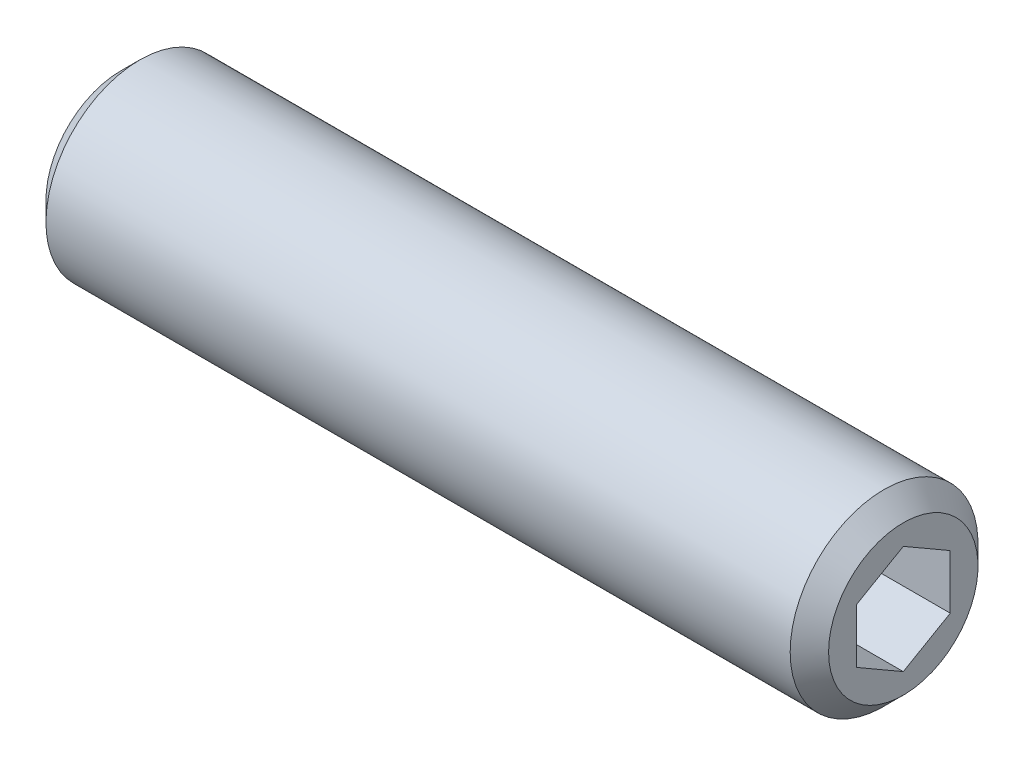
ISO-10303-21;
HEADER;
FILE_DESCRIPTION(('STEP AP214'),'2;1');
FILE_NAME('part.step','',(''),(''),'','','');
FILE_SCHEMA(('AUTOMOTIVE_DESIGN { 1 0 10303 214 1 1 1 1 }'));
ENDSEC;
DATA;
#1=APPLICATION_CONTEXT('core data for automotive mechanical design processes');
#2=APPLICATION_PROTOCOL_DEFINITION('international standard','automotive_design',2000,#1);
#3=PRODUCT_CONTEXT('',#1,'mechanical');
#4=PRODUCT('Part','Part','',(#3));
#5=PRODUCT_RELATED_PRODUCT_CATEGORY('part','',(#4));
#6=PRODUCT_DEFINITION_FORMATION('','',#4);
#7=PRODUCT_DEFINITION_CONTEXT('part definition',#1,'design');
#8=PRODUCT_DEFINITION('design','',#6,#7);
#9=PRODUCT_DEFINITION_SHAPE('','',#8);
#10=(LENGTH_UNIT() NAMED_UNIT(*) SI_UNIT(.MILLI.,.METRE.));
#11=(NAMED_UNIT(*) PLANE_ANGLE_UNIT() SI_UNIT($,.RADIAN.));
#12=(NAMED_UNIT(*) SI_UNIT($,.STERADIAN.) SOLID_ANGLE_UNIT());
#13=UNCERTAINTY_MEASURE_WITH_UNIT(LENGTH_MEASURE(1.E-05),#10,'distance_accuracy_value','');
#14=(GEOMETRIC_REPRESENTATION_CONTEXT(3) GLOBAL_UNCERTAINTY_ASSIGNED_CONTEXT((#13)) GLOBAL_UNIT_ASSIGNED_CONTEXT((#10,
#11,#12)) REPRESENTATION_CONTEXT('',''));
#15=CARTESIAN_POINT('',(0.,0.,0.));
#16=DIRECTION('',(0.,0.,1.));
#17=DIRECTION('',(1.,0.,0.));
#18=AXIS2_PLACEMENT_3D('',#15,#16,#17);
#19=CARTESIAN_POINT('',(25.,0.86602540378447,-1.49999999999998));
#20=DIRECTION('',(0.,0.866025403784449,-0.499999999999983));
#21=DIRECTION('',(0.,0.499999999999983,0.866025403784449));
#22=AXIS2_PLACEMENT_3D('',#19,#20,#21);
#23=PLANE('',#22);
#24=DIRECTION('',(-1.,0.,0.));
#25=VECTOR('',#24,1.);
#26=CARTESIAN_POINT('',(25.,0.866025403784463,-1.50000000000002));
#27=LINE('',#26,#25);
#28=CARTESIAN_POINT('',(21.4999999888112,0.866025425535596,-1.49999996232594));
#29=VERTEX_POINT('',#28);
#30=CARTESIAN_POINT('',(25.,0.866025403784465,-1.50000000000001));
#31=VERTEX_POINT('',#30);
#32=EDGE_CURVE('E188',#29,#31,#27,.F.);
#33=ORIENTED_EDGE('',*,*,#32,.T.);
#34=DIRECTION('',(0.,0.499999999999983,0.866025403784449));
#35=VECTOR('',#34,1.);
#36=CARTESIAN_POINT('',(25.,0.86602540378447,-1.49999999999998));
#37=LINE('',#36,#35);
#38=CARTESIAN_POINT('',(25.,1.73205080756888,0.));
#39=VERTEX_POINT('',#38);
#40=EDGE_CURVE('E192',#39,#31,#37,.F.);
#41=ORIENTED_EDGE('',*,*,#40,.F.);
#42=DIRECTION('',(1.,0.,0.));
#43=VECTOR('',#42,1.);
#44=CARTESIAN_POINT('',(25.,1.73205080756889,0.));
#45=LINE('',#44,#43);
#46=CARTESIAN_POINT('',(21.4999999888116,1.73205078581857,3.76726784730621E-08));
#47=VERTEX_POINT('',#46);
#48=EDGE_CURVE('E89',#39,#47,#45,.F.);
#49=ORIENTED_EDGE('',*,*,#48,.T.);
#50=CARTESIAN_POINT('',(21.5000000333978,1.73205078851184,4.15244747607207E-08));
#51=CARTESIAN_POINT('',(21.4780216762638,1.69399423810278,-0.0659158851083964));
#52=CARTESIAN_POINT('',(21.4580335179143,1.65560917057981,-0.132400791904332));
#53=CARTESIAN_POINT('',(21.4231447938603,1.57817441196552,-0.266521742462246));
#54=CARTESIAN_POINT('',(21.4082565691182,1.53912334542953,-0.334160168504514));
#55=CARTESIAN_POINT('',(21.3850819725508,1.46150515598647,-0.468598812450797));
#56=CARTESIAN_POINT('',(21.3766413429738,1.42294997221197,-0.535378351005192));
#57=CARTESIAN_POINT('',(21.3665668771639,1.34565828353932,-0.66925148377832));
#58=CARTESIAN_POINT('',(21.3649246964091,1.30692205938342,-0.736344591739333));
#59=CARTESIAN_POINT('',(21.3683497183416,1.23454758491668,-0.861700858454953));
#60=CARTESIAN_POINT('',(21.372575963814,1.20089847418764,-0.919982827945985));
#61=CARTESIAN_POINT('',(21.3859679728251,1.13381946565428,-1.03616707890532));
#62=CARTESIAN_POINT('',(21.3951383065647,1.10038979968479,-1.09406895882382));
#63=CARTESIAN_POINT('',(21.4180623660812,1.03317260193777,-1.21049256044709));
#64=CARTESIAN_POINT('',(21.4319132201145,0.999393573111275,-1.26899955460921));
#65=CARTESIAN_POINT('',(21.4633488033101,0.932339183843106,-1.38514116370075));
#66=CARTESIAN_POINT('',(21.4809261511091,0.899062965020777,-1.44277726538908));
#67=CARTESIAN_POINT('',(21.4999999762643,0.866025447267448,-1.49999992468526));
#68=B_SPLINE_CURVE_WITH_KNOTS('',3,(#50,#51,#52,#53,#54,#55,#56,#57,#58,#59,#60,#61,#62,#63,#64,
#65,#66,#67),.UNSPECIFIED.,.F.,.F.,(4,2,2,2,2,2,2,2,4),(0.,0.23776201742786,0.476095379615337,
0.708530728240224,0.940680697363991,1.14278084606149,1.34506813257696,1.55184118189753,
1.75820842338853),.UNSPECIFIED.);
#69=EDGE_CURVE('E88',#47,#29,#68,.T.);
#70=ORIENTED_EDGE('',*,*,#69,.T.);
#71=EDGE_LOOP('',(#33,#41,#49,#70));
#72=FACE_BOUND('',#71,.T.);
#73=ADVANCED_FACE('F16',(#72),#23,.F.);
#74=CARTESIAN_POINT('',(25.,-0.866025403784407,-1.50000000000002));
#75=DIRECTION('',(0.,0.,-1.));
#76=DIRECTION('',(-1.,0.,0.));
#77=AXIS2_PLACEMENT_3D('',#74,#75,#76);
#78=PLANE('',#77);
#79=DIRECTION('',(1.,0.,0.));
#80=VECTOR('',#79,1.);
#81=CARTESIAN_POINT('',(25.,-0.866025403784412,-1.50000000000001));
#82=LINE('',#81,#80);
#83=CARTESIAN_POINT('',(21.4999999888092,-0.866025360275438,-1.50000000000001));
#84=VERTEX_POINT('',#83);
#85=CARTESIAN_POINT('',(25.,-0.86602540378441,-1.50000000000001));
#86=VERTEX_POINT('',#85);
#87=EDGE_CURVE('E187',#84,#86,#82,.T.);
#88=ORIENTED_EDGE('',*,*,#87,.T.);
#89=DIRECTION('',(0.,1.,0.));
#90=VECTOR('',#89,1.);
#91=CARTESIAN_POINT('',(25.,-0.866025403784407,-1.50000000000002));
#92=LINE('',#91,#90);
#93=EDGE_CURVE('E185',#31,#86,#92,.F.);
#94=ORIENTED_EDGE('',*,*,#93,.F.);
#95=ORIENTED_EDGE('',*,*,#32,.F.);
#96=CARTESIAN_POINT('',(21.5000000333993,0.866025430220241,-1.49999996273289));
#97=CARTESIAN_POINT('',(21.4780216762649,0.78991228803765,-1.49999998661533));
#98=CARTESIAN_POINT('',(21.4580335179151,0.713142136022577,-1.4999999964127));
#99=CARTESIAN_POINT('',(21.4231447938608,0.558272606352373,-1.50000000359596));
#100=CARTESIAN_POINT('',(21.4082565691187,0.480170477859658,-1.50000000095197));
#101=CARTESIAN_POINT('',(21.3850819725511,0.32493410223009,-1.49999999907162));
#102=CARTESIAN_POINT('',(21.3766413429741,0.247823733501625,-1.49999999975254));
#103=CARTESIAN_POINT('',(21.3665668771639,0.0932403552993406,-1.5000000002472));
#104=CARTESIAN_POINT('',(21.3649246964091,0.0157679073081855,-1.500000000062));
#105=CARTESIAN_POINT('',(21.3683497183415,-0.128981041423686,-1.49999999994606));
#106=CARTESIAN_POINT('',(21.3725759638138,-0.196279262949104,-1.49999999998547));
#107=CARTESIAN_POINT('',(21.3859679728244,-0.330437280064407,-1.50000000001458));
#108=CARTESIAN_POINT('',(21.3951383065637,-0.397296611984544,-1.50000000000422));
#109=CARTESIAN_POINT('',(21.4180623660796,-0.531731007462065,-1.49999999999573));
#110=CARTESIAN_POINT('',(21.4319132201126,-0.599289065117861,-1.49999999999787));
#111=CARTESIAN_POINT('',(21.4633488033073,-0.733397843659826,-1.50000000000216));
#112=CARTESIAN_POINT('',(21.4809261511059,-0.799950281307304,-1.50000000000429));
#113=CARTESIAN_POINT('',(21.4999999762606,-0.866025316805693,-1.50000000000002));
#114=B_SPLINE_CURVE_WITH_KNOTS('',3,(#96,#97,#98,#99,#100,#101,#102,#103,#104,#105,#106,#107,
#108,#109,#110,#111,#112,#113),.UNSPECIFIED.,.F.,.F.,(4,2,2,2,2,2,2,2,4),(0.,0.23776201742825,
0.476095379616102,0.708530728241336,0.940680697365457,1.14278084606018,1.34506813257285,
1.55184118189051,1.75820842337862),.UNSPECIFIED.);
#115=EDGE_CURVE('E129',#29,#84,#114,.T.);
#116=ORIENTED_EDGE('',*,*,#115,.T.);
#117=EDGE_LOOP('',(#88,#94,#95,#116));
#118=FACE_BOUND('',#117,.T.);
#119=ADVANCED_FACE('F133',(#118),#78,.F.);
#120=CARTESIAN_POINT('',(25.,-1.73205080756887,0.));
#121=DIRECTION('',(0.,-0.866025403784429,-0.500000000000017));
#122=DIRECTION('',(0.,0.500000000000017,-0.866025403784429));
#123=AXIS2_PLACEMENT_3D('',#120,#121,#122);
#124=PLANE('',#123);
#125=DIRECTION('',(1.,0.,0.));
#126=VECTOR('',#125,1.);
#127=CARTESIAN_POINT('',(25.,-1.73205080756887,0.));
#128=LINE('',#127,#126);
#129=CARTESIAN_POINT('',(21.4999999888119,-1.73205078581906,-3.76718099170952E-08));
#130=VERTEX_POINT('',#129);
#131=CARTESIAN_POINT('',(25.,-1.73205080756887,0.));
#132=VERTEX_POINT('',#131);
#133=EDGE_CURVE('E191',#130,#132,#128,.T.);
#134=ORIENTED_EDGE('',*,*,#133,.T.);
#135=DIRECTION('',(0.,0.500000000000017,-0.866025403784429));
#136=VECTOR('',#135,1.);
#137=CARTESIAN_POINT('',(25.,-1.73205080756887,0.));
#138=LINE('',#137,#136);
#139=EDGE_CURVE('E189',#86,#132,#138,.F.);
#140=ORIENTED_EDGE('',*,*,#139,.F.);
#141=ORIENTED_EDGE('',*,*,#87,.F.);
#142=CARTESIAN_POINT('',(21.5000000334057,-0.86602535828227,-1.5000000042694));
#143=CARTESIAN_POINT('',(21.4780216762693,-0.904081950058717,-1.43408410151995));
#144=CARTESIAN_POINT('',(21.4580335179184,-0.942467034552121,-1.36759920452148));
#145=CARTESIAN_POINT('',(21.4231447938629,-1.01990180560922,-1.23347826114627));
#146=CARTESIAN_POINT('',(21.4082565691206,-1.05895286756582,-1.16583983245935));
#147=CARTESIAN_POINT('',(21.3850819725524,-1.13657105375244,-1.03140118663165));
#148=CARTESIAN_POINT('',(21.376641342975,-1.17512623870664,-0.964621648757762));
#149=CARTESIAN_POINT('',(21.3665668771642,-1.25241792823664,-0.830748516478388));
#150=CARTESIAN_POINT('',(21.3649246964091,-1.29115415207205,-0.763655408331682));
#151=CARTESIAN_POINT('',(21.3683497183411,-1.36352862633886,-0.638299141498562));
#152=CARTESIAN_POINT('',(21.3725759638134,-1.39717773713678,-0.580017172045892));
#153=CARTESIAN_POINT('',(21.3859679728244,-1.46425674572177,-0.463832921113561));
#154=CARTESIAN_POINT('',(21.3951383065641,-1.49768641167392,-0.405931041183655));
#155=CARTESIAN_POINT('',(21.4180623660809,-1.56490360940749,-0.28950743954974));
#156=CARTESIAN_POINT('',(21.4319132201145,-1.59868263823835,-0.231000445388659));
#157=CARTESIAN_POINT('',(21.4633488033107,-1.66573702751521,-0.114858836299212));
#158=CARTESIAN_POINT('',(21.4809261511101,-1.69901324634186,-0.0572227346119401));
#159=CARTESIAN_POINT('',(21.4999999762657,-1.7320507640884,-7.53104211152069E-08));
#160=B_SPLINE_CURVE_WITH_KNOTS('',3,(#142,#143,#144,#145,#146,#147,#148,#149,#150,#151,#152,
#153,#154,#155,#156,#157,#158,#159),.UNSPECIFIED.,.F.,.F.,(4,2,2,2,2,2,2,2,4),(0.,
0.237762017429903,0.47609537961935,0.708530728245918,0.940680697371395,1.14278084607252,
1.34506813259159,1.55184118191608,1.75820842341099),.UNSPECIFIED.);
#161=EDGE_CURVE('E124',#84,#130,#160,.T.);
#162=ORIENTED_EDGE('',*,*,#161,.T.);
#163=EDGE_LOOP('',(#134,#140,#141,#162));
#164=FACE_BOUND('',#163,.T.);
#165=ADVANCED_FACE('F136',(#164),#124,.F.);
#166=CARTESIAN_POINT('',(25.,-0.866025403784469,1.49999999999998));
#167=DIRECTION('',(0.,-0.866025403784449,0.499999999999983));
#168=DIRECTION('',(0.,-0.499999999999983,-0.866025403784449));
#169=AXIS2_PLACEMENT_3D('',#166,#167,#168);
#170=PLANE('',#169);
#171=DIRECTION('',(1.,0.,0.));
#172=VECTOR('',#171,1.);
#173=CARTESIAN_POINT('',(25.,-0.866025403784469,1.50000000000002));
#174=LINE('',#173,#172);
#175=CARTESIAN_POINT('',(21.4999999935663,-0.866025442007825,1.49999996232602));
#176=VERTEX_POINT('',#175);
#177=CARTESIAN_POINT('',(25.,-0.866025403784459,1.50000000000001));
#178=VERTEX_POINT('',#177);
#179=EDGE_CURVE('E80',#176,#178,#174,.T.);
#180=ORIENTED_EDGE('',*,*,#179,.T.);
#181=DIRECTION('',(0.,-0.499999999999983,-0.866025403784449));
#182=VECTOR('',#181,1.);
#183=CARTESIAN_POINT('',(25.,-0.866025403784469,1.49999999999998));
#184=LINE('',#183,#182);
#185=EDGE_CURVE('E198',#132,#178,#184,.F.);
#186=ORIENTED_EDGE('',*,*,#185,.F.);
#187=ORIENTED_EDGE('',*,*,#133,.F.);
#188=CARTESIAN_POINT('',(21.5000000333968,-1.73205078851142,-4.15224953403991E-08));
#189=CARTESIAN_POINT('',(21.4780216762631,-1.69399423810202,0.0659158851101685));
#190=CARTESIAN_POINT('',(21.4580335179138,-1.65560917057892,0.132400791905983));
#191=CARTESIAN_POINT('',(21.42314479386,-1.57817441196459,0.266521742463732));
#192=CARTESIAN_POINT('',(21.408256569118,-1.53912334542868,0.334160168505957));
#193=CARTESIAN_POINT('',(21.3850819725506,-1.46150515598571,0.468598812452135));
#194=CARTESIAN_POINT('',(21.3766413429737,-1.42294997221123,0.535378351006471));
#195=CARTESIAN_POINT('',(21.3665668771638,-1.34565828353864,0.669251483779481));
#196=CARTESIAN_POINT('',(21.3649246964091,-1.30692205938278,0.736344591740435));
#197=CARTESIAN_POINT('',(21.3683497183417,-1.23454758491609,0.861700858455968));
#198=CARTESIAN_POINT('',(21.3725759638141,-1.20089847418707,0.919982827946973));
#199=CARTESIAN_POINT('',(21.3859679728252,-1.13381946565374,1.03616707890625));
#200=CARTESIAN_POINT('',(21.3951383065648,-1.10038979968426,1.09406895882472));
#201=CARTESIAN_POINT('',(21.4180623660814,-1.03317260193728,1.21049256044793));
#202=CARTESIAN_POINT('',(21.4319132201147,-0.999393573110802,1.26899955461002));
#203=CARTESIAN_POINT('',(21.4633488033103,-0.932339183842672,1.3851411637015));
#204=CARTESIAN_POINT('',(21.4809261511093,-0.899062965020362,1.44277726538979));
#205=CARTESIAN_POINT('',(21.4999999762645,-0.866025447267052,1.49999992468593));
#206=B_SPLINE_CURVE_WITH_KNOTS('',3,(#188,#189,#190,#191,#192,#193,#194,#195,#196,#197,#198,
#199,#200,#201,#202,#203,#204,#205),.UNSPECIFIED.,.F.,.F.,(4,2,2,2,2,2,2,2,4),(0.,
0.237762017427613,0.476095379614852,0.708530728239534,0.940680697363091,1.14278084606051,
1.34506813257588,1.55184118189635,1.75820842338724),.UNSPECIFIED.);
#207=EDGE_CURVE('E103',#130,#176,#206,.T.);
#208=ORIENTED_EDGE('',*,*,#207,.T.);
#209=EDGE_LOOP('',(#180,#186,#187,#208));
#210=FACE_BOUND('',#209,.T.);
#211=ADVANCED_FACE('F140',(#210),#170,.F.);
#212=CARTESIAN_POINT('',(25.,1.73205080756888,0.));
#213=DIRECTION('',(0.,0.866025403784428,0.500000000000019));
#214=DIRECTION('',(0.,-0.500000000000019,0.866025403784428));
#215=AXIS2_PLACEMENT_3D('',#212,#213,#214);
#216=PLANE('',#215);
#217=ORIENTED_EDGE('',*,*,#48,.F.);
#218=DIRECTION('',(0.,-0.500000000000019,0.866025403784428));
#219=VECTOR('',#218,1.);
#220=CARTESIAN_POINT('',(25.,1.73205080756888,0.));
#221=LINE('',#220,#219);
#222=CARTESIAN_POINT('',(25.,0.866025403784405,1.50000000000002));
#223=VERTEX_POINT('',#222);
#224=EDGE_CURVE('E40',#223,#39,#221,.F.);
#225=ORIENTED_EDGE('',*,*,#224,.F.);
#226=DIRECTION('',(1.,0.,0.));
#227=VECTOR('',#226,1.);
#228=CARTESIAN_POINT('',(25.,0.866025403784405,1.50000000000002));
#229=LINE('',#228,#227);
#230=CARTESIAN_POINT('',(21.4999999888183,0.866025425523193,1.49999996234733));
#231=VERTEX_POINT('',#230);
#232=EDGE_CURVE('E71',#223,#231,#229,.F.);
#233=ORIENTED_EDGE('',*,*,#232,.T.);
#234=CARTESIAN_POINT('',(21.4999999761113,0.866025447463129,1.49999992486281));
#235=CARTESIAN_POINT('',(21.4780216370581,0.904082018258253,1.43408401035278));
#236=CARTESIAN_POINT('',(21.4580334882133,0.94246709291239,1.36759911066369));
#237=CARTESIAN_POINT('',(21.4231447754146,1.01990185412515,1.23347816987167));
#238=CARTESIAN_POINT('',(21.4082565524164,1.0589529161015,1.16583974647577));
#239=CARTESIAN_POINT('',(21.3850819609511,1.1365710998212,1.03140110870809));
#240=CARTESIAN_POINT('',(21.3766413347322,1.17512628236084,0.964621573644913));
#241=CARTESIAN_POINT('',(21.3665668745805,1.25241796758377,0.830748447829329));
#242=CARTESIAN_POINT('',(21.3649246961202,1.29115418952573,0.763655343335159));
#243=CARTESIAN_POINT('',(21.3683497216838,1.36352865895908,0.638299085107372));
#244=CARTESIAN_POINT('',(21.3725759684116,1.39717776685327,0.580017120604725));
#245=CARTESIAN_POINT('',(21.3859679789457,1.46425676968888,0.463832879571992));
#246=CARTESIAN_POINT('',(21.3951383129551,1.49768643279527,0.405931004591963));
#247=CARTESIAN_POINT('',(21.4180623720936,1.56490362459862,0.289507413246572));
#248=CARTESIAN_POINT('',(21.4319132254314,1.59868265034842,0.231000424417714));
#249=CARTESIAN_POINT('',(21.463348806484,1.6657370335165,0.114858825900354));
#250=CARTESIAN_POINT('',(21.4809261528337,1.69901324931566,0.0572227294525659));
#251=CARTESIAN_POINT('',(21.4999999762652,1.73205076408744,7.53120907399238E-08));
#252=B_SPLINE_CURVE_WITH_KNOTS('',3,(#234,#235,#236,#237,#238,#239,#240,#241,#242,#243,#244,
#245,#246,#247,#248,#249,#250,#251),.UNSPECIFIED.,.F.,.F.,(4,2,2,2,2,2,2,2,4),(0.,
0.237762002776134,0.476095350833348,0.708530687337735,0.940680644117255,1.14278077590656,
1.34506804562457,1.5518410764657,1.75820829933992),.UNSPECIFIED.);
#253=EDGE_CURVE('E20',#231,#47,#252,.T.);
#254=ORIENTED_EDGE('',*,*,#253,.T.);
#255=EDGE_LOOP('',(#217,#225,#233,#254));
#256=FACE_BOUND('',#255,.T.);
#257=ADVANCED_FACE('F73',(#256),#216,.F.);
#258=CARTESIAN_POINT('',(21.5060000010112,0.,0.));
#259=DIRECTION('',(1.,0.,0.));
#260=DIRECTION('',(0.,0.,-1.));
#261=AXIS2_PLACEMENT_3D('',#258,#259,#260);
#262=CONICAL_SURFACE('',#261,1.74244311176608,1.04719755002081);
#263=CARTESIAN_POINT('',(20.4999999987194,1.13686837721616E-10,0.));
#264=VERTEX_POINT('',#263);
#265=VERTEX_LOOP('',#264);
#266=FACE_BOUND('',#265,.T.);
#267=ORIENTED_EDGE('',*,*,#207,.F.);
#268=ORIENTED_EDGE('',*,*,#161,.F.);
#269=ORIENTED_EDGE('',*,*,#115,.F.);
#270=ORIENTED_EDGE('',*,*,#69,.F.);
#271=ORIENTED_EDGE('',*,*,#253,.F.);
#272=CARTESIAN_POINT('',(21.5000000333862,0.866025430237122,1.49999996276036));
#273=CARTESIAN_POINT('',(21.4780216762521,0.789912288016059,1.4999999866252));
#274=CARTESIAN_POINT('',(21.458033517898,0.713142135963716,1.49999999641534));
#275=CARTESIAN_POINT('',(21.4231447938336,0.558272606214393,1.50000000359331));
#276=CARTESIAN_POINT('',(21.4082565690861,0.480170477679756,1.50000000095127));
#277=CARTESIAN_POINT('',(21.3850819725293,0.324934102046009,1.4999999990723));
#278=CARTESIAN_POINT('',(21.3766413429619,0.2478237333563,1.49999999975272));
#279=CARTESIAN_POINT('',(21.3665668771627,0.0932403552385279,1.50000000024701));
#280=CARTESIAN_POINT('',(21.3649246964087,0.0157679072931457,1.50000000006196));
#281=CARTESIAN_POINT('',(21.3683497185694,-0.128981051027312,1.4999999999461));
#282=CARTESIAN_POINT('',(21.3725759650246,-0.196279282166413,1.49999999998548));
#283=CARTESIAN_POINT('',(21.3859679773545,-0.330437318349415,1.50000000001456));
#284=CARTESIAN_POINT('',(21.3951383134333,-0.397296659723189,1.50000000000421));
#285=CARTESIAN_POINT('',(21.4180623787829,-0.531731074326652,1.49999999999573));
#286=CARTESIAN_POINT('',(21.4319132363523,-0.599289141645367,1.49999999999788));
#287=CARTESIAN_POINT('',(21.4633488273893,-0.733397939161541,1.50000000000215));
#288=CARTESIAN_POINT('',(21.480926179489,-0.799950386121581,1.50000000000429));
#289=CARTESIAN_POINT('',(21.5000000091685,-0.866025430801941,1.50000000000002));
#290=B_SPLINE_CURVE_WITH_KNOTS('',3,(#272,#273,#274,#275,#276,#277,#278,#279,#280,#281,#282,
#283,#284,#285,#286,#287,#288,#289),.UNSPECIFIED.,.F.,.F.,(4,2,2,2,2,2,2,2,4),(0.,
0.237762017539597,0.476095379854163,0.708530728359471,0.940680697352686,1.14278087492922,
1.34506819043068,1.55184127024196,1.75820854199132),.UNSPECIFIED.);
#291=EDGE_CURVE('E79',#231,#176,#290,.T.);
#292=ORIENTED_EDGE('',*,*,#291,.T.);
#293=EDGE_LOOP('',(#267,#268,#269,#270,#271,#292));
#294=FACE_BOUND('',#293,.T.);
#295=ADVANCED_FACE('F85',(#266,#294),#262,.F.);
#296=CARTESIAN_POINT('',(25.,0.866025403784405,1.50000000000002));
#297=DIRECTION('',(0.,0.,1.));
#298=DIRECTION('',(1.,0.,0.));
#299=AXIS2_PLACEMENT_3D('',#296,#297,#298);
#300=PLANE('',#299);
#301=ORIENTED_EDGE('',*,*,#232,.F.);
#302=DIRECTION('',(0.,1.,0.));
#303=VECTOR('',#302,1.);
#304=CARTESIAN_POINT('',(25.,0.,1.50000000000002));
#305=LINE('',#304,#303);
#306=EDGE_CURVE('E92',#223,#178,#305,.F.);
#307=ORIENTED_EDGE('',*,*,#306,.T.);
#308=ORIENTED_EDGE('',*,*,#179,.F.);
#309=ORIENTED_EDGE('',*,*,#291,.F.);
#310=EDGE_LOOP('',(#301,#307,#308,#309));
#311=FACE_BOUND('',#310,.T.);
#312=ADVANCED_FACE('F90',(#311),#300,.F.);
#313=CARTESIAN_POINT('',(25.,0.,0.));
#314=DIRECTION('',(-1.,0.,0.));
#315=DIRECTION('',(0.,0.,1.));
#316=AXIS2_PLACEMENT_3D('',#313,#314,#315);
#317=PLANE('',#316);
#318=ORIENTED_EDGE('',*,*,#224,.T.);
#319=ORIENTED_EDGE('',*,*,#40,.T.);
#320=ORIENTED_EDGE('',*,*,#93,.T.);
#321=ORIENTED_EDGE('',*,*,#139,.T.);
#322=ORIENTED_EDGE('',*,*,#185,.T.);
#323=ORIENTED_EDGE('',*,*,#306,.F.);
#324=EDGE_LOOP('',(#318,#319,#320,#321,#322,#323));
#325=FACE_BOUND('',#324,.T.);
#326=CARTESIAN_POINT('',(25.0000000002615,0.,0.));
#327=DIRECTION('',(-1.,0.,0.));
#328=DIRECTION('',(0.,0.,1.));
#329=AXIS2_PLACEMENT_3D('',#326,#327,#328);
#330=CIRCLE('',#329,2.38655000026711);
#331=CARTESIAN_POINT('',(25.0000000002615,0.,2.38655000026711));
#332=VERTEX_POINT('',#331);
#333=EDGE_CURVE('E94',#332,#332,#330,.T.);
#334=ORIENTED_EDGE('',*,*,#333,.F.);
#335=EDGE_LOOP('',(#334));
#336=FACE_BOUND('',#335,.T.);
#337=ADVANCED_FACE('F167',(#325,#336),#317,.F.);
#338=CARTESIAN_POINT('',(0.,1.5,0.));
#339=DIRECTION('',(-1.,0.,0.));
#340=DIRECTION('',(0.,0.,1.));
#341=AXIS2_PLACEMENT_3D('',#338,#339,#340);
#342=PLANE('',#341);
#343=CARTESIAN_POINT('',(-2.84217202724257E-10,0.,0.));
#344=DIRECTION('',(1.,0.,0.));
#345=DIRECTION('',(0.,1.,0.));
#346=AXIS2_PLACEMENT_3D('',#343,#344,#345);
#347=CIRCLE('',#346,2.38655000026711);
#348=CARTESIAN_POINT('',(-2.84217375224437E-10,2.38655000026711,0.));
#349=VERTEX_POINT('',#348);
#350=EDGE_CURVE('E178',#349,#349,#347,.T.);
#351=ORIENTED_EDGE('',*,*,#350,.F.);
#352=EDGE_LOOP('',(#351));
#353=FACE_BOUND('',#352,.T.);
#354=ADVANCED_FACE('F164',(#353),#342,.T.);
#355=CARTESIAN_POINT('',(24.3865499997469,0.,0.));
#356=DIRECTION('',(-1.,0.,0.));
#357=DIRECTION('',(0.,0.,1.));
#358=AXIS2_PLACEMENT_3D('',#355,#356,#357);
#359=CONICAL_SURFACE('',#358,2.99999999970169,0.785398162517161);
#360=ORIENTED_EDGE('',*,*,#333,.T.);
#361=EDGE_LOOP('',(#360));
#362=FACE_BOUND('',#361,.T.);
#363=CARTESIAN_POINT('',(24.38655,0.,0.));
#364=DIRECTION('',(1.,0.,0.));
#365=DIRECTION('',(0.,1.,0.));
#366=AXIS2_PLACEMENT_3D('',#363,#364,#365);
#367=CIRCLE('',#366,3.);
#368=CARTESIAN_POINT('',(24.38655,3.,0.));
#369=VERTEX_POINT('',#368);
#370=EDGE_CURVE('E31',#369,#369,#367,.F.);
#371=ORIENTED_EDGE('',*,*,#370,.F.);
#372=EDGE_LOOP('',(#371));
#373=FACE_BOUND('',#372,.T.);
#374=ADVANCED_FACE('F157',(#362,#373),#359,.T.);
#375=CARTESIAN_POINT('',(0.613450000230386,0.,0.));
#376=DIRECTION('',(1.,0.,0.));
#377=DIRECTION('',(0.,1.,0.));
#378=AXIS2_PLACEMENT_3D('',#375,#376,#377);
#379=CONICAL_SURFACE('',#378,2.99999999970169,0.785398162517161);
#380=CARTESIAN_POINT('',(0.61345,0.,0.));
#381=DIRECTION('',(1.,0.,0.));
#382=DIRECTION('',(0.,1.,0.));
#383=AXIS2_PLACEMENT_3D('',#380,#381,#382);
#384=CIRCLE('',#383,3.);
#385=CARTESIAN_POINT('',(0.613449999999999,3.,0.));
#386=VERTEX_POINT('',#385);
#387=EDGE_CURVE('E11',#386,#386,#384,.T.);
#388=ORIENTED_EDGE('',*,*,#387,.F.);
#389=EDGE_LOOP('',(#388));
#390=FACE_BOUND('',#389,.T.);
#391=ORIENTED_EDGE('',*,*,#350,.T.);
#392=EDGE_LOOP('',(#391));
#393=FACE_BOUND('',#392,.T.);
#394=ADVANCED_FACE('F151',(#390,#393),#379,.T.);
#395=CARTESIAN_POINT('',(12.5,0.,0.));
#396=DIRECTION('',(1.,0.,0.));
#397=DIRECTION('',(0.,1.,0.));
#398=AXIS2_PLACEMENT_3D('',#395,#396,#397);
#399=CYLINDRICAL_SURFACE('',#398,3.);
#400=ORIENTED_EDGE('',*,*,#387,.T.);
#401=EDGE_LOOP('',(#400));
#402=FACE_BOUND('',#401,.T.);
#403=ORIENTED_EDGE('',*,*,#370,.T.);
#404=EDGE_LOOP('',(#403));
#405=FACE_BOUND('',#404,.T.);
#406=ADVANCED_FACE('F149',(#402,#405),#399,.T.);
#407=CLOSED_SHELL('',(#73,#119,#165,#211,#257,#295,#312,#337,#354,#374,#394,#406));
#408=MANIFOLD_SOLID_BREP('B1',#407);
#409=ADVANCED_BREP_SHAPE_REPRESENTATION('',(#18,#408),#14);
#410=SHAPE_DEFINITION_REPRESENTATION(#9,#409);
ENDSEC;
END-ISO-10303-21;
